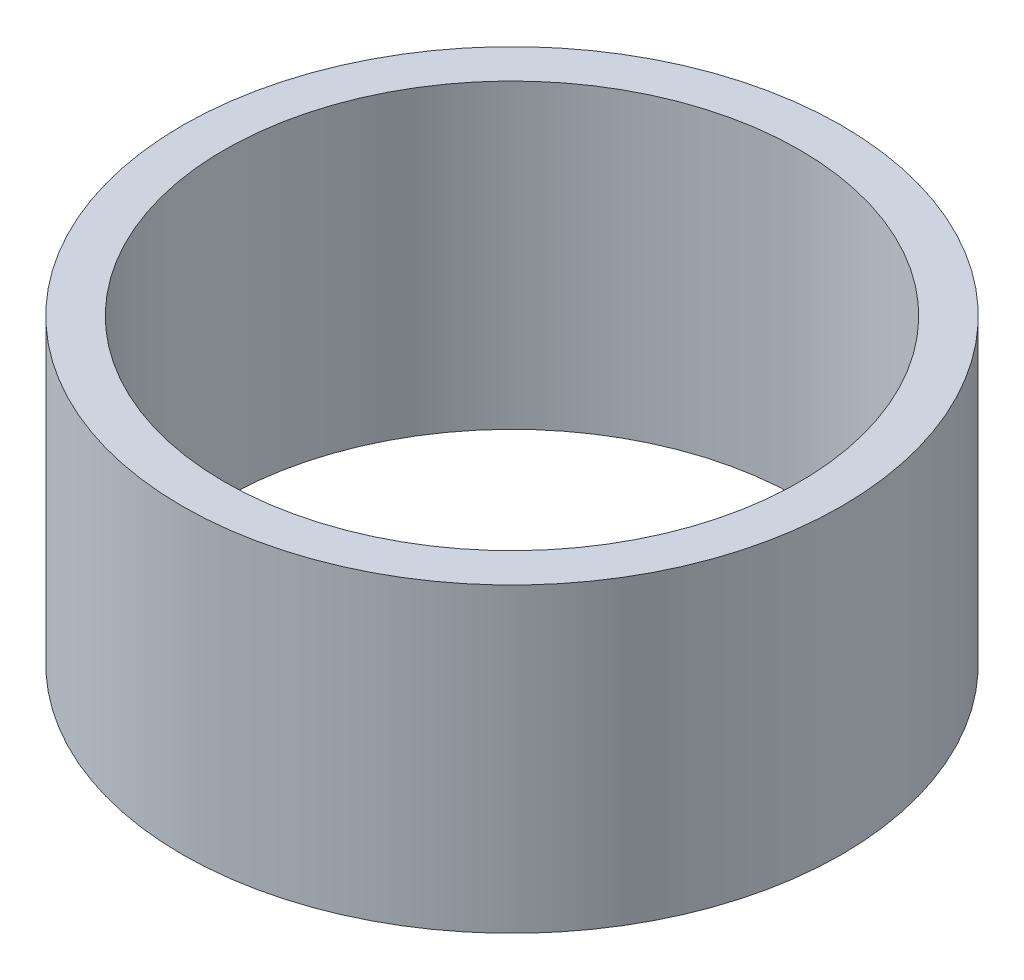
ISO-10303-21;
HEADER;
FILE_DESCRIPTION(('STEP AP214'),'2;1');
FILE_NAME('part.step','',(''),(''),'','','');
FILE_SCHEMA(('AUTOMOTIVE_DESIGN { 1 0 10303 214 1 1 1 1 }'));
ENDSEC;
DATA;
#1=APPLICATION_CONTEXT('core data for automotive mechanical design processes');
#2=APPLICATION_PROTOCOL_DEFINITION('international standard','automotive_design',2000,#1);
#3=PRODUCT_CONTEXT('',#1,'mechanical');
#4=PRODUCT('Part','Part','',(#3));
#5=PRODUCT_RELATED_PRODUCT_CATEGORY('part','',(#4));
#6=PRODUCT_DEFINITION_FORMATION('','',#4);
#7=PRODUCT_DEFINITION_CONTEXT('part definition',#1,'design');
#8=PRODUCT_DEFINITION('design','',#6,#7);
#9=PRODUCT_DEFINITION_SHAPE('','',#8);
#10=(LENGTH_UNIT() NAMED_UNIT(*) SI_UNIT(.MILLI.,.METRE.));
#11=(NAMED_UNIT(*) PLANE_ANGLE_UNIT() SI_UNIT($,.RADIAN.));
#12=(NAMED_UNIT(*) SI_UNIT($,.STERADIAN.) SOLID_ANGLE_UNIT());
#13=UNCERTAINTY_MEASURE_WITH_UNIT(LENGTH_MEASURE(1.E-05),#10,'distance_accuracy_value','');
#14=(GEOMETRIC_REPRESENTATION_CONTEXT(3) GLOBAL_UNCERTAINTY_ASSIGNED_CONTEXT((#13)) GLOBAL_UNIT_ASSIGNED_CONTEXT((#10,
#11,#12)) REPRESENTATION_CONTEXT('',''));
#15=CARTESIAN_POINT('',(0.,0.,0.));
#16=DIRECTION('',(0.,0.,1.));
#17=DIRECTION('',(1.,0.,0.));
#18=AXIS2_PLACEMENT_3D('',#15,#16,#17);
#19=CARTESIAN_POINT('',(0.,28.120065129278,0.));
#20=DIRECTION('',(0.,1.,0.));
#21=DIRECTION('',(0.,0.,1.));
#22=AXIS2_PLACEMENT_3D('',#19,#20,#21);
#23=CYLINDRICAL_SURFACE('',#22,20.5);
#24=CARTESIAN_POINT('',(0.,0.,0.));
#25=DIRECTION('',(0.,1.,0.));
#26=DIRECTION('',(0.,0.,1.));
#27=AXIS2_PLACEMENT_3D('',#24,#25,#26);
#28=CIRCLE('',#27,20.5);
#29=CARTESIAN_POINT('',(0.,0.,20.5));
#30=VERTEX_POINT('',#29);
#31=EDGE_CURVE('E10',#30,#30,#28,.T.);
#32=ORIENTED_EDGE('',*,*,#31,.F.);
#33=EDGE_LOOP('',(#32));
#34=FACE_BOUND('',#33,.T.);
#35=CARTESIAN_POINT('',(0.,21.5,0.));
#36=DIRECTION('',(0.,1.,0.));
#37=DIRECTION('',(0.,0.,1.));
#38=AXIS2_PLACEMENT_3D('',#35,#36,#37);
#39=CIRCLE('',#38,20.5);
#40=CARTESIAN_POINT('',(0.,21.5,20.5));
#41=VERTEX_POINT('',#40);
#42=EDGE_CURVE('E43',#41,#41,#39,.T.);
#43=ORIENTED_EDGE('',*,*,#42,.T.);
#44=EDGE_LOOP('',(#43));
#45=FACE_BOUND('',#44,.T.);
#46=ADVANCED_FACE('F29',(#34,#45),#23,.F.);
#47=CARTESIAN_POINT('',(20.5,0.,0.));
#48=DIRECTION('',(0.,1.,0.));
#49=DIRECTION('',(0.,0.,1.));
#50=AXIS2_PLACEMENT_3D('',#47,#48,#49);
#51=PLANE('',#50);
#52=CARTESIAN_POINT('',(0.,0.,0.));
#53=DIRECTION('',(0.,1.,0.));
#54=DIRECTION('',(0.,0.,1.));
#55=AXIS2_PLACEMENT_3D('',#52,#53,#54);
#56=CIRCLE('',#55,23.5);
#57=CARTESIAN_POINT('',(0.,0.,23.5));
#58=VERTEX_POINT('',#57);
#59=EDGE_CURVE('E35',#58,#58,#56,.T.);
#60=ORIENTED_EDGE('',*,*,#59,.F.);
#61=EDGE_LOOP('',(#60));
#62=FACE_BOUND('',#61,.T.);
#63=ORIENTED_EDGE('',*,*,#31,.T.);
#64=EDGE_LOOP('',(#63));
#65=FACE_BOUND('',#64,.T.);
#66=ADVANCED_FACE('F58',(#62,#65),#51,.F.);
#67=CARTESIAN_POINT('',(0.,28.120065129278,0.));
#68=DIRECTION('',(0.,1.,0.));
#69=DIRECTION('',(0.,0.,1.));
#70=AXIS2_PLACEMENT_3D('',#67,#68,#69);
#71=CYLINDRICAL_SURFACE('',#70,23.5);
#72=CARTESIAN_POINT('',(0.,21.5,0.));
#73=DIRECTION('',(0.,1.,0.));
#74=DIRECTION('',(0.,0.,1.));
#75=AXIS2_PLACEMENT_3D('',#72,#73,#74);
#76=CIRCLE('',#75,23.5);
#77=CARTESIAN_POINT('',(0.,21.5,23.5));
#78=VERTEX_POINT('',#77);
#79=EDGE_CURVE('E39',#78,#78,#76,.T.);
#80=ORIENTED_EDGE('',*,*,#79,.F.);
#81=EDGE_LOOP('',(#80));
#82=FACE_BOUND('',#81,.T.);
#83=ORIENTED_EDGE('',*,*,#59,.T.);
#84=EDGE_LOOP('',(#83));
#85=FACE_BOUND('',#84,.T.);
#86=ADVANCED_FACE('F53',(#82,#85),#71,.T.);
#87=CARTESIAN_POINT('',(20.5,21.5,0.));
#88=DIRECTION('',(0.,-1.,0.));
#89=DIRECTION('',(0.,0.,-1.));
#90=AXIS2_PLACEMENT_3D('',#87,#88,#89);
#91=PLANE('',#90);
#92=ORIENTED_EDGE('',*,*,#42,.F.);
#93=EDGE_LOOP('',(#92));
#94=FACE_BOUND('',#93,.T.);
#95=ORIENTED_EDGE('',*,*,#79,.T.);
#96=EDGE_LOOP('',(#95));
#97=FACE_BOUND('',#96,.T.);
#98=ADVANCED_FACE('F50',(#94,#97),#91,.F.);
#99=CLOSED_SHELL('',(#46,#66,#86,#98));
#100=MANIFOLD_SOLID_BREP('B2',#99);
#101=ADVANCED_BREP_SHAPE_REPRESENTATION('',(#18,#100),#14);
#102=SHAPE_DEFINITION_REPRESENTATION(#9,#101);
ENDSEC;
END-ISO-10303-21;
